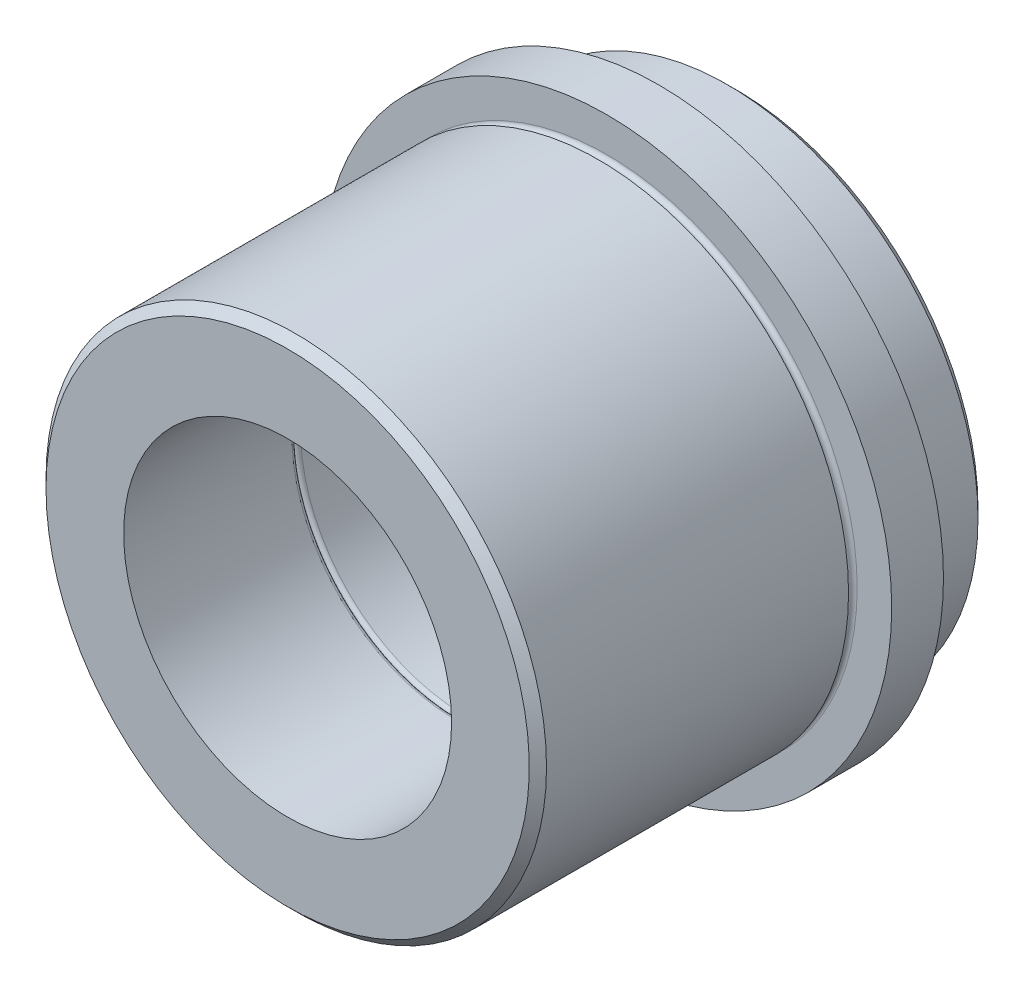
ISO-10303-21;
HEADER;
FILE_DESCRIPTION(('STEP AP214'),'2;1');
FILE_NAME('part.step','',(''),(''),'','','');
FILE_SCHEMA(('AUTOMOTIVE_DESIGN { 1 0 10303 214 1 1 1 1 }'));
ENDSEC;
DATA;
#1=APPLICATION_CONTEXT('core data for automotive mechanical design processes');
#2=APPLICATION_PROTOCOL_DEFINITION('international standard','automotive_design',2000,#1);
#3=PRODUCT_CONTEXT('',#1,'mechanical');
#4=PRODUCT('Part','Part','',(#3));
#5=PRODUCT_RELATED_PRODUCT_CATEGORY('part','',(#4));
#6=PRODUCT_DEFINITION_FORMATION('','',#4);
#7=PRODUCT_DEFINITION_CONTEXT('part definition',#1,'design');
#8=PRODUCT_DEFINITION('design','',#6,#7);
#9=PRODUCT_DEFINITION_SHAPE('','',#8);
#10=(LENGTH_UNIT() NAMED_UNIT(*) SI_UNIT(.MILLI.,.METRE.));
#11=(NAMED_UNIT(*) PLANE_ANGLE_UNIT() SI_UNIT($,.RADIAN.));
#12=(NAMED_UNIT(*) SI_UNIT($,.STERADIAN.) SOLID_ANGLE_UNIT());
#13=UNCERTAINTY_MEASURE_WITH_UNIT(LENGTH_MEASURE(1.E-05),#10,'distance_accuracy_value','');
#14=(GEOMETRIC_REPRESENTATION_CONTEXT(3) GLOBAL_UNCERTAINTY_ASSIGNED_CONTEXT((#13)) GLOBAL_UNIT_ASSIGNED_CONTEXT((#10,
#11,#12)) REPRESENTATION_CONTEXT('',''));
#15=CARTESIAN_POINT('',(0.,0.,0.));
#16=DIRECTION('',(0.,0.,1.));
#17=DIRECTION('',(1.,0.,0.));
#18=AXIS2_PLACEMENT_3D('',#15,#16,#17);
#19=CARTESIAN_POINT('',(0.,0.,0.));
#20=DIRECTION('',(0.,0.,1.));
#21=DIRECTION('',(1.,0.,0.));
#22=AXIS2_PLACEMENT_3D('',#19,#20,#21);
#23=CYLINDRICAL_SURFACE('',#22,19.);
#24=CARTESIAN_POINT('',(0.,0.,-19.5));
#25=DIRECTION('',(0.,0.,1.));
#26=DIRECTION('',(1.,0.,0.));
#27=AXIS2_PLACEMENT_3D('',#24,#25,#26);
#28=CIRCLE('',#27,19.);
#29=CARTESIAN_POINT('',(19.,0.,-19.5));
#30=VERTEX_POINT('',#29);
#31=EDGE_CURVE('E69',#30,#30,#28,.T.);
#32=ORIENTED_EDGE('',*,*,#31,.F.);
#33=EDGE_LOOP('',(#32));
#34=FACE_BOUND('',#33,.T.);
#35=CARTESIAN_POINT('',(0.,0.,0.));
#36=DIRECTION('',(0.,0.,1.));
#37=DIRECTION('',(1.,0.,0.));
#38=AXIS2_PLACEMENT_3D('',#35,#36,#37);
#39=CIRCLE('',#38,19.);
#40=CARTESIAN_POINT('',(19.,0.,0.));
#41=VERTEX_POINT('',#40);
#42=EDGE_CURVE('E33',#41,#41,#39,.T.);
#43=ORIENTED_EDGE('',*,*,#42,.T.);
#44=EDGE_LOOP('',(#43));
#45=FACE_BOUND('',#44,.T.);
#46=ADVANCED_FACE('F13',(#34,#45),#23,.F.);
#47=CARTESIAN_POINT('',(0.,19.,0.));
#48=DIRECTION('',(0.,0.,-1.));
#49=DIRECTION('',(-1.,0.,0.));
#50=AXIS2_PLACEMENT_3D('',#47,#48,#49);
#51=PLANE('',#50);
#52=CARTESIAN_POINT('',(0.,0.,0.));
#53=DIRECTION('',(0.,0.,-1.));
#54=DIRECTION('',(-1.,0.,0.));
#55=AXIS2_PLACEMENT_3D('',#52,#53,#54);
#56=CIRCLE('',#55,28.);
#57=CARTESIAN_POINT('',(-28.,0.,0.));
#58=VERTEX_POINT('',#57);
#59=EDGE_CURVE('E20',#58,#58,#56,.F.);
#60=ORIENTED_EDGE('',*,*,#59,.T.);
#61=EDGE_LOOP('',(#60));
#62=FACE_BOUND('',#61,.T.);
#63=ORIENTED_EDGE('',*,*,#42,.F.);
#64=EDGE_LOOP('',(#63));
#65=FACE_BOUND('',#64,.T.);
#66=ADVANCED_FACE('F77',(#62,#65),#51,.F.);
#67=CARTESIAN_POINT('',(0.,0.,0.));
#68=DIRECTION('',(0.,0.,1.));
#69=DIRECTION('',(1.,0.,0.));
#70=AXIS2_PLACEMENT_3D('',#67,#68,#69);
#71=CYLINDRICAL_SURFACE('',#70,29.);
#72=CARTESIAN_POINT('',(0.,0.,-0.99999999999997));
#73=DIRECTION('',(0.,0.,-1.));
#74=DIRECTION('',(-1.,0.,0.));
#75=AXIS2_PLACEMENT_3D('',#72,#73,#74);
#76=CIRCLE('',#75,29.);
#77=CARTESIAN_POINT('',(-29.,0.,-0.99999999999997));
#78=VERTEX_POINT('',#77);
#79=EDGE_CURVE('E8',#78,#78,#76,.T.);
#80=ORIENTED_EDGE('',*,*,#79,.T.);
#81=EDGE_LOOP('',(#80));
#82=FACE_BOUND('',#81,.T.);
#83=CARTESIAN_POINT('',(0.,0.,-36.));
#84=DIRECTION('',(0.,0.,1.));
#85=DIRECTION('',(1.,0.,0.));
#86=AXIS2_PLACEMENT_3D('',#83,#84,#85);
#87=CIRCLE('',#86,29.);
#88=CARTESIAN_POINT('',(29.,0.,-36.));
#89=VERTEX_POINT('',#88);
#90=EDGE_CURVE('E36',#89,#89,#87,.T.);
#91=ORIENTED_EDGE('',*,*,#90,.T.);
#92=EDGE_LOOP('',(#91));
#93=FACE_BOUND('',#92,.T.);
#94=ADVANCED_FACE('F82',(#82,#93),#71,.T.);
#95=CARTESIAN_POINT('',(0.,0.,-36.5));
#96=DIRECTION('',(0.,0.,1.));
#97=DIRECTION('',(1.,0.,0.));
#98=AXIS2_PLACEMENT_3D('',#95,#96,#97);
#99=TOROIDAL_SURFACE('',#98,29.,0.5);
#100=ORIENTED_EDGE('',*,*,#90,.F.);
#101=EDGE_LOOP('',(#100));
#102=FACE_BOUND('',#101,.T.);
#103=CARTESIAN_POINT('',(0.,0.,-37.));
#104=DIRECTION('',(0.,0.,1.));
#105=DIRECTION('',(1.,0.,0.));
#106=AXIS2_PLACEMENT_3D('',#103,#104,#105);
#107=CIRCLE('',#106,29.);
#108=CARTESIAN_POINT('',(29.,0.,-37.));
#109=VERTEX_POINT('',#108);
#110=EDGE_CURVE('E39',#109,#109,#107,.T.);
#111=ORIENTED_EDGE('',*,*,#110,.T.);
#112=EDGE_LOOP('',(#111));
#113=FACE_BOUND('',#112,.T.);
#114=ADVANCED_FACE('F89',(#102,#113),#99,.F.);
#115=CARTESIAN_POINT('',(0.,29.,-37.));
#116=DIRECTION('',(0.,0.,-1.));
#117=DIRECTION('',(-1.,0.,0.));
#118=AXIS2_PLACEMENT_3D('',#115,#116,#117);
#119=PLANE('',#118);
#120=ORIENTED_EDGE('',*,*,#110,.F.);
#121=EDGE_LOOP('',(#120));
#122=FACE_BOUND('',#121,.T.);
#123=CARTESIAN_POINT('',(0.,0.,-37.));
#124=DIRECTION('',(0.,0.,1.));
#125=DIRECTION('',(1.,0.,0.));
#126=AXIS2_PLACEMENT_3D('',#123,#124,#125);
#127=CIRCLE('',#126,33.);
#128=CARTESIAN_POINT('',(33.,0.,-37.));
#129=VERTEX_POINT('',#128);
#130=EDGE_CURVE('E42',#129,#129,#127,.T.);
#131=ORIENTED_EDGE('',*,*,#130,.T.);
#132=EDGE_LOOP('',(#131));
#133=FACE_BOUND('',#132,.T.);
#134=ADVANCED_FACE('F124',(#122,#133),#119,.F.);
#135=CARTESIAN_POINT('',(0.,0.,0.));
#136=DIRECTION('',(0.,0.,1.));
#137=DIRECTION('',(1.,0.,0.));
#138=AXIS2_PLACEMENT_3D('',#135,#136,#137);
#139=CYLINDRICAL_SURFACE('',#138,33.);
#140=ORIENTED_EDGE('',*,*,#130,.F.);
#141=EDGE_LOOP('',(#140));
#142=FACE_BOUND('',#141,.T.);
#143=CARTESIAN_POINT('',(0.,0.,-43.));
#144=DIRECTION('',(0.,0.,1.));
#145=DIRECTION('',(1.,0.,0.));
#146=AXIS2_PLACEMENT_3D('',#143,#144,#145);
#147=CIRCLE('',#146,33.);
#148=CARTESIAN_POINT('',(33.,0.,-43.));
#149=VERTEX_POINT('',#148);
#150=EDGE_CURVE('E45',#149,#149,#147,.T.);
#151=ORIENTED_EDGE('',*,*,#150,.T.);
#152=EDGE_LOOP('',(#151));
#153=FACE_BOUND('',#152,.T.);
#154=ADVANCED_FACE('F117',(#142,#153),#139,.T.);
#155=CARTESIAN_POINT('',(0.,33.,-43.));
#156=DIRECTION('',(0.,0.,1.));
#157=DIRECTION('',(1.,0.,0.));
#158=AXIS2_PLACEMENT_3D('',#155,#156,#157);
#159=PLANE('',#158);
#160=ORIENTED_EDGE('',*,*,#150,.F.);
#161=EDGE_LOOP('',(#160));
#162=FACE_BOUND('',#161,.T.);
#163=CARTESIAN_POINT('',(0.,0.,-43.));
#164=DIRECTION('',(0.,0.,1.));
#165=DIRECTION('',(1.,0.,0.));
#166=AXIS2_PLACEMENT_3D('',#163,#164,#165);
#167=CIRCLE('',#166,29.);
#168=CARTESIAN_POINT('',(29.,0.,-43.));
#169=VERTEX_POINT('',#168);
#170=EDGE_CURVE('E48',#169,#169,#167,.T.);
#171=ORIENTED_EDGE('',*,*,#170,.T.);
#172=EDGE_LOOP('',(#171));
#173=FACE_BOUND('',#172,.T.);
#174=ADVANCED_FACE('F112',(#162,#173),#159,.F.);
#175=CARTESIAN_POINT('',(0.,0.,0.));
#176=DIRECTION('',(0.,0.,1.));
#177=DIRECTION('',(1.,0.,0.));
#178=AXIS2_PLACEMENT_3D('',#175,#176,#177);
#179=CYLINDRICAL_SURFACE('',#178,29.);
#180=CARTESIAN_POINT('',(0.,0.,-51.));
#181=DIRECTION('',(0.,0.,1.));
#182=DIRECTION('',(1.,0.,0.));
#183=AXIS2_PLACEMENT_3D('',#180,#181,#182);
#184=CIRCLE('',#183,29.);
#185=CARTESIAN_POINT('',(29.,0.,-51.));
#186=VERTEX_POINT('',#185);
#187=EDGE_CURVE('E28',#186,#186,#184,.T.);
#188=ORIENTED_EDGE('',*,*,#187,.T.);
#189=EDGE_LOOP('',(#188));
#190=FACE_BOUND('',#189,.T.);
#191=ORIENTED_EDGE('',*,*,#170,.F.);
#192=EDGE_LOOP('',(#191));
#193=FACE_BOUND('',#192,.T.);
#194=ADVANCED_FACE('F108',(#190,#193),#179,.T.);
#195=CARTESIAN_POINT('',(0.,29.,-52.));
#196=DIRECTION('',(0.,0.,1.));
#197=DIRECTION('',(1.,0.,0.));
#198=AXIS2_PLACEMENT_3D('',#195,#196,#197);
#199=PLANE('',#198);
#200=CARTESIAN_POINT('',(0.,0.,-52.));
#201=DIRECTION('',(0.,0.,1.));
#202=DIRECTION('',(1.,0.,0.));
#203=AXIS2_PLACEMENT_3D('',#200,#201,#202);
#204=CIRCLE('',#203,28.);
#205=CARTESIAN_POINT('',(28.,0.,-52.));
#206=VERTEX_POINT('',#205);
#207=EDGE_CURVE('E24',#206,#206,#204,.F.);
#208=ORIENTED_EDGE('',*,*,#207,.T.);
#209=EDGE_LOOP('',(#208));
#210=FACE_BOUND('',#209,.T.);
#211=CARTESIAN_POINT('',(0.,0.,-52.));
#212=DIRECTION('',(0.,0.,1.));
#213=DIRECTION('',(1.,0.,0.));
#214=AXIS2_PLACEMENT_3D('',#211,#212,#213);
#215=CIRCLE('',#214,19.);
#216=CARTESIAN_POINT('',(19.,0.,-52.));
#217=VERTEX_POINT('',#216);
#218=EDGE_CURVE('E51',#217,#217,#215,.T.);
#219=ORIENTED_EDGE('',*,*,#218,.T.);
#220=EDGE_LOOP('',(#219));
#221=FACE_BOUND('',#220,.T.);
#222=ADVANCED_FACE('F111',(#210,#221),#199,.F.);
#223=CARTESIAN_POINT('',(0.,0.,0.));
#224=DIRECTION('',(0.,0.,1.));
#225=DIRECTION('',(1.,0.,0.));
#226=AXIS2_PLACEMENT_3D('',#223,#224,#225);
#227=CYLINDRICAL_SURFACE('',#226,19.);
#228=ORIENTED_EDGE('',*,*,#218,.F.);
#229=EDGE_LOOP('',(#228));
#230=FACE_BOUND('',#229,.T.);
#231=CARTESIAN_POINT('',(0.,0.,-40.5));
#232=DIRECTION('',(0.,0.,1.));
#233=DIRECTION('',(1.,0.,0.));
#234=AXIS2_PLACEMENT_3D('',#231,#232,#233);
#235=CIRCLE('',#234,19.);
#236=CARTESIAN_POINT('',(19.,0.,-40.5));
#237=VERTEX_POINT('',#236);
#238=EDGE_CURVE('E54',#237,#237,#235,.T.);
#239=ORIENTED_EDGE('',*,*,#238,.T.);
#240=EDGE_LOOP('',(#239));
#241=FACE_BOUND('',#240,.T.);
#242=ADVANCED_FACE('F240',(#230,#241),#227,.F.);
#243=CARTESIAN_POINT('',(0.,0.,-40.5));
#244=DIRECTION('',(0.,0.,1.));
#245=DIRECTION('',(1.,0.,0.));
#246=AXIS2_PLACEMENT_3D('',#243,#244,#245);
#247=TOROIDAL_SURFACE('',#246,19.5,0.5);
#248=ORIENTED_EDGE('',*,*,#238,.F.);
#249=EDGE_LOOP('',(#248));
#250=FACE_BOUND('',#249,.T.);
#251=CARTESIAN_POINT('',(0.,0.,-40.));
#252=DIRECTION('',(0.,0.,1.));
#253=DIRECTION('',(1.,0.,0.));
#254=AXIS2_PLACEMENT_3D('',#251,#252,#253);
#255=CIRCLE('',#254,19.5);
#256=CARTESIAN_POINT('',(19.5,0.,-40.));
#257=VERTEX_POINT('',#256);
#258=EDGE_CURVE('E57',#257,#257,#255,.T.);
#259=ORIENTED_EDGE('',*,*,#258,.T.);
#260=EDGE_LOOP('',(#259));
#261=FACE_BOUND('',#260,.T.);
#262=ADVANCED_FACE('F231',(#250,#261),#247,.T.);
#263=CARTESIAN_POINT('',(0.,0.,-39.5));
#264=DIRECTION('',(0.,0.,1.));
#265=DIRECTION('',(1.,0.,0.));
#266=AXIS2_PLACEMENT_3D('',#263,#264,#265);
#267=TOROIDAL_SURFACE('',#266,19.5,0.5);
#268=ORIENTED_EDGE('',*,*,#258,.F.);
#269=EDGE_LOOP('',(#268));
#270=FACE_BOUND('',#269,.T.);
#271=CARTESIAN_POINT('',(0.,0.,-39.5));
#272=DIRECTION('',(0.,0.,1.));
#273=DIRECTION('',(1.,0.,0.));
#274=AXIS2_PLACEMENT_3D('',#271,#272,#273);
#275=CIRCLE('',#274,19.);
#276=CARTESIAN_POINT('',(19.,0.,-39.5));
#277=VERTEX_POINT('',#276);
#278=EDGE_CURVE('E60',#277,#277,#275,.T.);
#279=ORIENTED_EDGE('',*,*,#278,.T.);
#280=EDGE_LOOP('',(#279));
#281=FACE_BOUND('',#280,.T.);
#282=ADVANCED_FACE('F222',(#270,#281),#267,.T.);
#283=CARTESIAN_POINT('',(0.,0.,0.));
#284=DIRECTION('',(0.,0.,1.));
#285=DIRECTION('',(1.,0.,0.));
#286=AXIS2_PLACEMENT_3D('',#283,#284,#285);
#287=CYLINDRICAL_SURFACE('',#286,19.);
#288=ORIENTED_EDGE('',*,*,#278,.F.);
#289=EDGE_LOOP('',(#288));
#290=FACE_BOUND('',#289,.T.);
#291=CARTESIAN_POINT('',(0.,0.,-20.5));
#292=DIRECTION('',(0.,0.,1.));
#293=DIRECTION('',(1.,0.,0.));
#294=AXIS2_PLACEMENT_3D('',#291,#292,#293);
#295=CIRCLE('',#294,19.);
#296=CARTESIAN_POINT('',(19.,0.,-20.5));
#297=VERTEX_POINT('',#296);
#298=EDGE_CURVE('E63',#297,#297,#295,.T.);
#299=ORIENTED_EDGE('',*,*,#298,.T.);
#300=EDGE_LOOP('',(#299));
#301=FACE_BOUND('',#300,.T.);
#302=ADVANCED_FACE('F214',(#290,#301),#287,.F.);
#303=CARTESIAN_POINT('',(0.,0.,-20.5));
#304=DIRECTION('',(0.,0.,1.));
#305=DIRECTION('',(1.,0.,0.));
#306=AXIS2_PLACEMENT_3D('',#303,#304,#305);
#307=TOROIDAL_SURFACE('',#306,19.5,0.5);
#308=ORIENTED_EDGE('',*,*,#298,.F.);
#309=EDGE_LOOP('',(#308));
#310=FACE_BOUND('',#309,.T.);
#311=CARTESIAN_POINT('',(0.,0.,-20.));
#312=DIRECTION('',(0.,0.,1.));
#313=DIRECTION('',(1.,0.,0.));
#314=AXIS2_PLACEMENT_3D('',#311,#312,#313);
#315=CIRCLE('',#314,19.5);
#316=CARTESIAN_POINT('',(19.5,0.,-20.));
#317=VERTEX_POINT('',#316);
#318=EDGE_CURVE('E66',#317,#317,#315,.T.);
#319=ORIENTED_EDGE('',*,*,#318,.T.);
#320=EDGE_LOOP('',(#319));
#321=FACE_BOUND('',#320,.T.);
#322=ADVANCED_FACE('F101',(#310,#321),#307,.T.);
#323=CARTESIAN_POINT('',(0.,0.,-19.5));
#324=DIRECTION('',(0.,0.,1.));
#325=DIRECTION('',(1.,0.,0.));
#326=AXIS2_PLACEMENT_3D('',#323,#324,#325);
#327=TOROIDAL_SURFACE('',#326,19.5,0.5);
#328=ORIENTED_EDGE('',*,*,#318,.F.);
#329=EDGE_LOOP('',(#328));
#330=FACE_BOUND('',#329,.T.);
#331=ORIENTED_EDGE('',*,*,#31,.T.);
#332=EDGE_LOOP('',(#331));
#333=FACE_BOUND('',#332,.T.);
#334=ADVANCED_FACE('F73',(#330,#333),#327,.T.);
#335=CARTESIAN_POINT('',(0.,0.,-51.));
#336=DIRECTION('',(0.,0.,1.));
#337=DIRECTION('',(1.,0.,0.));
#338=AXIS2_PLACEMENT_3D('',#335,#336,#337);
#339=CONICAL_SURFACE('',#338,29.,0.785398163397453);
#340=ORIENTED_EDGE('',*,*,#207,.F.);
#341=EDGE_LOOP('',(#340));
#342=FACE_BOUND('',#341,.T.);
#343=ORIENTED_EDGE('',*,*,#187,.F.);
#344=EDGE_LOOP('',(#343));
#345=FACE_BOUND('',#344,.T.);
#346=ADVANCED_FACE('F92',(#342,#345),#339,.T.);
#347=CARTESIAN_POINT('',(0.,0.,0.));
#348=DIRECTION('',(0.,0.,-1.));
#349=DIRECTION('',(-1.,0.,0.));
#350=AXIS2_PLACEMENT_3D('',#347,#348,#349);
#351=CONICAL_SURFACE('',#350,28.,0.785398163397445);
#352=ORIENTED_EDGE('',*,*,#79,.F.);
#353=EDGE_LOOP('',(#352));
#354=FACE_BOUND('',#353,.T.);
#355=ORIENTED_EDGE('',*,*,#59,.F.);
#356=EDGE_LOOP('',(#355));
#357=FACE_BOUND('',#356,.T.);
#358=ADVANCED_FACE('F15',(#354,#357),#351,.T.);
#359=CLOSED_SHELL('',(#46,#66,#94,#114,#134,#154,#174,#194,#222,#242,#262,#282,#302,#322,#334,
#346,#358));
#360=MANIFOLD_SOLID_BREP('B1',#359);
#361=ADVANCED_BREP_SHAPE_REPRESENTATION('',(#18,#360),#14);
#362=SHAPE_DEFINITION_REPRESENTATION(#9,#361);
ENDSEC;
END-ISO-10303-21;
